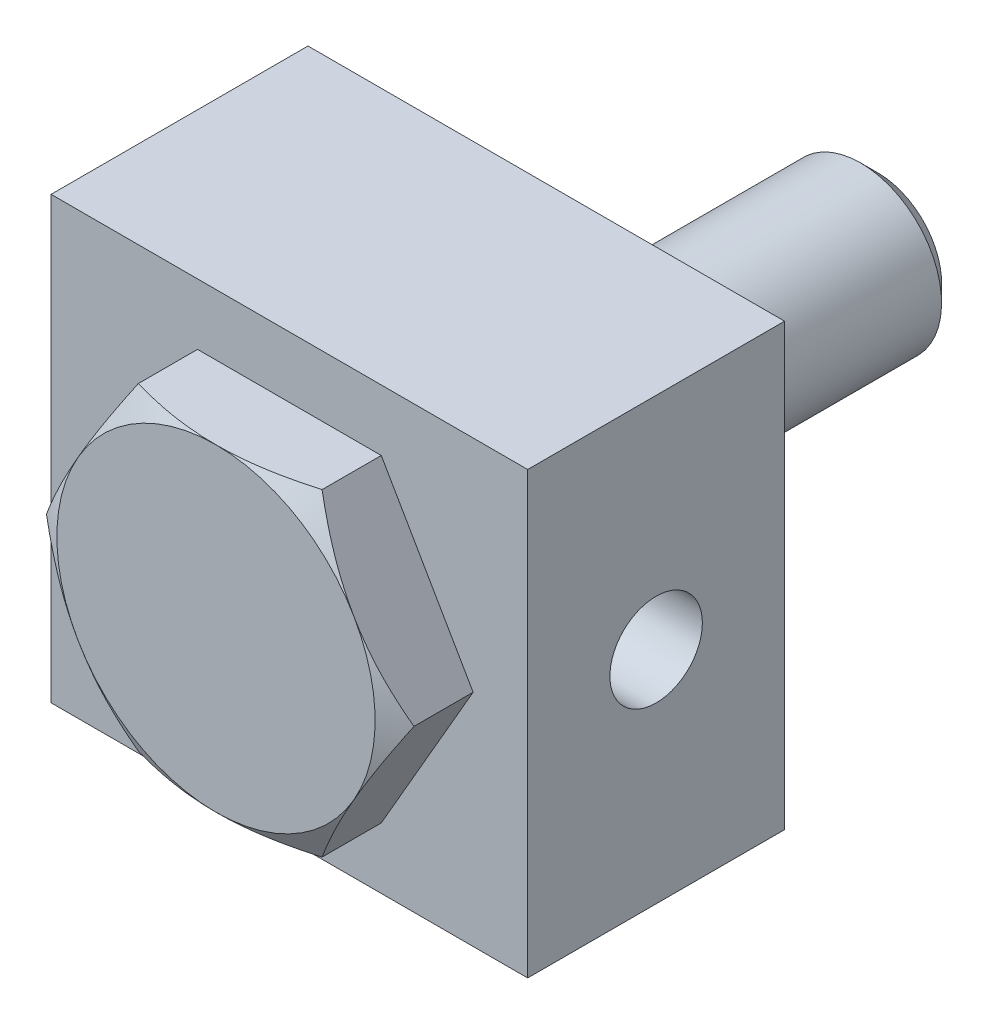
ISO-10303-21;
HEADER;
FILE_DESCRIPTION(('STEP AP214'),'2;1');
FILE_NAME('part.step','',(''),(''),'','','');
FILE_SCHEMA(('AUTOMOTIVE_DESIGN { 1 0 10303 214 1 1 1 1 }'));
ENDSEC;
DATA;
#1=APPLICATION_CONTEXT('core data for automotive mechanical design processes');
#2=APPLICATION_PROTOCOL_DEFINITION('international standard','automotive_design',2000,#1);
#3=PRODUCT_CONTEXT('',#1,'mechanical');
#4=PRODUCT('Part','Part','',(#3));
#5=PRODUCT_RELATED_PRODUCT_CATEGORY('part','',(#4));
#6=PRODUCT_DEFINITION_FORMATION('','',#4);
#7=PRODUCT_DEFINITION_CONTEXT('part definition',#1,'design');
#8=PRODUCT_DEFINITION('design','',#6,#7);
#9=PRODUCT_DEFINITION_SHAPE('','',#8);
#10=(LENGTH_UNIT() NAMED_UNIT(*) SI_UNIT(.MILLI.,.METRE.));
#11=(NAMED_UNIT(*) PLANE_ANGLE_UNIT() SI_UNIT($,.RADIAN.));
#12=(NAMED_UNIT(*) SI_UNIT($,.STERADIAN.) SOLID_ANGLE_UNIT());
#13=UNCERTAINTY_MEASURE_WITH_UNIT(LENGTH_MEASURE(1.E-05),#10,'distance_accuracy_value','');
#14=(GEOMETRIC_REPRESENTATION_CONTEXT(3) GLOBAL_UNCERTAINTY_ASSIGNED_CONTEXT((#13)) GLOBAL_UNIT_ASSIGNED_CONTEXT((#10,
#11,#12)) REPRESENTATION_CONTEXT('',''));
#15=CARTESIAN_POINT('',(0.,0.,0.));
#16=DIRECTION('',(0.,0.,1.));
#17=DIRECTION('',(1.,0.,0.));
#18=AXIS2_PLACEMENT_3D('',#15,#16,#17);
#19=CARTESIAN_POINT('',(-41.7703,41.7703,88.519));
#20=DIRECTION('',(0.,0.,1.));
#21=DIRECTION('',(0.,-1.,0.));
#22=AXIS2_PLACEMENT_3D('',#19,#20,#21);
#23=PLANE('',#22);
#24=CARTESIAN_POINT('',(0.,0.,88.519));
#25=DIRECTION('',(0.,0.,1.));
#26=DIRECTION('',(0.,-1.,0.));
#27=AXIS2_PLACEMENT_3D('',#24,#25,#26);
#28=CIRCLE('',#27,41.3);
#29=CARTESIAN_POINT('',(0.,-41.3,88.519));
#30=VERTEX_POINT('',#29);
#31=CARTESIAN_POINT('',(-35.7668491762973,-20.65,88.519));
#32=VERTEX_POINT('',#31);
#33=EDGE_CURVE('E113',#30,#32,#28,.F.);
#34=ORIENTED_EDGE('',*,*,#33,.F.);
#35=CARTESIAN_POINT('',(35.7668491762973,-20.65,88.519));
#36=VERTEX_POINT('',#35);
#37=EDGE_CURVE('E126',#36,#30,#28,.F.);
#38=ORIENTED_EDGE('',*,*,#37,.F.);
#39=CARTESIAN_POINT('',(35.7668491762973,20.65,88.519));
#40=VERTEX_POINT('',#39);
#41=EDGE_CURVE('E132',#40,#36,#28,.F.);
#42=ORIENTED_EDGE('',*,*,#41,.F.);
#43=CARTESIAN_POINT('',(0.,0.,88.519));
#44=DIRECTION('',(0.,0.,1.));
#45=DIRECTION('',(1.,0.,0.));
#46=AXIS2_PLACEMENT_3D('',#43,#44,#45);
#47=CIRCLE('',#46,41.3);
#48=CARTESIAN_POINT('',(0.,41.3,88.519));
#49=VERTEX_POINT('',#48);
#50=EDGE_CURVE('E359',#40,#49,#47,.T.);
#51=ORIENTED_EDGE('',*,*,#50,.T.);
#52=CARTESIAN_POINT('',(-35.7668491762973,20.65,88.519));
#53=VERTEX_POINT('',#52);
#54=EDGE_CURVE('E539',#53,#49,#28,.F.);
#55=ORIENTED_EDGE('',*,*,#54,.F.);
#56=EDGE_CURVE('E136',#32,#53,#28,.F.);
#57=ORIENTED_EDGE('',*,*,#56,.F.);
#58=EDGE_LOOP('',(#34,#38,#42,#51,#55,#57));
#59=FACE_BOUND('',#58,.T.);
#60=ADVANCED_FACE('F14',(#59),#23,.T.);
#61=CARTESIAN_POINT('',(0.,0.,78.8727471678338));
#62=DIRECTION('',(0.,0.,-1.));
#63=DIRECTION('',(-1.,0.,0.));
#64=AXIS2_PLACEMENT_3D('',#61,#62,#63);
#65=CONICAL_SURFACE('',#64,58.0078000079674,1.0471975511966);
#66=ORIENTED_EDGE('',*,*,#33,.T.);
#67=CARTESIAN_POINT('',(-23.8444506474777,-41.3002,84.8301661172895));
#68=CARTESIAN_POINT('',(-24.3685431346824,-40.3924451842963,85.1327273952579));
#69=CARTESIAN_POINT('',(-24.8946798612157,-39.4811496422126,85.4215586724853));
#70=CARTESIAN_POINT('',(-25.9511722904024,-37.6512510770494,85.967944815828));
#71=CARTESIAN_POINT('',(-26.4815293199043,-36.7326457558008,86.2254893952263));
#72=CARTESIAN_POINT('',(-27.5474986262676,-34.8863327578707,86.7058452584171));
#73=CARTESIAN_POINT('',(-28.0831203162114,-33.958608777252,86.9285735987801));
#74=CARTESIAN_POINT('',(-29.1580627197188,-32.0967539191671,87.3344988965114));
#75=CARTESIAN_POINT('',(-29.6973830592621,-31.1626236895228,87.5176997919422));
#76=CARTESIAN_POINT('',(-30.7659373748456,-29.3118333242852,87.8367936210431));
#77=CARTESIAN_POINT('',(-31.2950920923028,-28.3953104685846,87.973741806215));
#78=CARTESIAN_POINT('',(-32.3558261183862,-26.5580652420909,88.203371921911));
#79=CARTESIAN_POINT('',(-32.887405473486,-25.6373427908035,88.2960530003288));
#80=CARTESIAN_POINT('',(-33.9514570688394,-23.7943513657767,88.4348087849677));
#81=CARTESIAN_POINT('',(-34.4839274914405,-22.8720855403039,88.4809388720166));
#82=CARTESIAN_POINT('',(-35.5493597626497,-21.0267027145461,88.525600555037));
#83=CARTESIAN_POINT('',(-36.0823215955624,-20.1035857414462,88.524133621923));
#84=CARTESIAN_POINT('',(-37.0786961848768,-18.3778143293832,88.476926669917));
#85=CARTESIAN_POINT('',(-37.5421799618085,-17.5750368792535,88.4369431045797));
#86=CARTESIAN_POINT('',(-38.4680421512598,-15.9713965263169,88.3217374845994));
#87=CARTESIAN_POINT('',(-38.9304205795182,-15.1705335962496,88.2465159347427));
#88=CARTESIAN_POINT('',(-39.8538957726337,-13.571027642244,88.0621424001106));
#89=CARTESIAN_POINT('',(-40.3149909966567,-12.7723872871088,87.9529597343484));
#90=CARTESIAN_POINT('',(-41.2349897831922,-11.1789026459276,87.7025797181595));
#91=CARTESIAN_POINT('',(-41.6938933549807,-10.3840583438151,87.5613825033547));
#92=CARTESIAN_POINT('',(-42.6192515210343,-8.78129098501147,87.2457582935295));
#93=CARTESIAN_POINT('',(-43.0856491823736,-7.97346653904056,87.0706665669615));
#94=CARTESIAN_POINT('',(-44.0155899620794,-6.36276186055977,86.6919247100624));
#95=CARTESIAN_POINT('',(-44.4791326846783,-5.55988231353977,86.4882707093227));
#96=CARTESIAN_POINT('',(-45.4022766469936,-3.96095006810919,86.0554861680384));
#97=CARTESIAN_POINT('',(-45.8618837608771,-3.1648871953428,85.8264054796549));
#98=CARTESIAN_POINT('',(-46.7779191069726,-1.57826743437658,85.3450529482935));
#99=CARTESIAN_POINT('',(-47.2343481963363,-0.787709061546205,85.0927876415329));
#100=CARTESIAN_POINT('',(-47.689247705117,0.000199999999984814,84.8301661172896));
#101=B_SPLINE_CURVE_WITH_KNOTS('',3,(#67,#68,#69,#70,#71,#72,#73,#74,#75,#76,#77,#78,#79,#80,
#81,#82,#83,#84,#85,#86,#87,#88,#89,#90,#91,#92,#93,#94,#95,#96,#97,#98,#99,#100),.UNSPECIFIED.,
.F.,.F.,(4,2,2,2,2,2,2,2,2,2,2,2,2,2,2,2,4),(0.,3.27302247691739,6.54711819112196,
9.82889872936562,13.110352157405,16.3108811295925,19.5114717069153,22.7082500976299,
25.9049296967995,28.6877475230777,31.470525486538,34.2558247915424,37.0411122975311,
39.8878840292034,42.7350418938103,45.5767129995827,48.4175854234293),.UNSPECIFIED.);
#102=CARTESIAN_POINT('',(-23.8445661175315,-41.3,84.8302327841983));
#103=VERTEX_POINT('',#102);
#104=EDGE_CURVE('E116',#103,#32,#101,.T.);
#105=ORIENTED_EDGE('',*,*,#104,.F.);
#106=CARTESIAN_POINT('',(-64.0693641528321,-41.3,68.3538193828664));
#107=CARTESIAN_POINT('',(-63.1674107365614,-41.3,68.7914941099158));
#108=CARTESIAN_POINT('',(-62.264398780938,-41.3,69.2269946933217));
#109=CARTESIAN_POINT('',(-60.4560384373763,-41.3,70.0931399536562));
#110=CARTESIAN_POINT('',(-59.5506900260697,-41.3,70.5237845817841));
#111=CARTESIAN_POINT('',(-57.737315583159,-41.3,71.37976755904));
#112=CARTESIAN_POINT('',(-56.8292891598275,-41.3,71.8051050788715));
#113=CARTESIAN_POINT('',(-55.0104615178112,-41.3,72.6498031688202));
#114=CARTESIAN_POINT('',(-54.099660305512,-41.3,73.0691637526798));
#115=CARTESIAN_POINT('',(-52.2700525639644,-41.3,73.9034920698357));
#116=CARTESIAN_POINT('',(-51.3512294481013,-41.3,74.3184234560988));
#117=CARTESIAN_POINT('',(-49.5102220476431,-41.3,75.1407598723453));
#118=CARTESIAN_POINT('',(-48.5880377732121,-41.3,75.5481649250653));
#119=CARTESIAN_POINT('',(-46.7400185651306,-41.3,76.3545246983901));
#120=CARTESIAN_POINT('',(-45.8141837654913,-41.3,76.7534797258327));
#121=CARTESIAN_POINT('',(-43.9584905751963,-41.3,77.5419052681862));
#122=CARTESIAN_POINT('',(-43.0286322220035,-41.3,77.9313758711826));
#123=CARTESIAN_POINT('',(-41.1344932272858,-41.3,78.7120058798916));
#124=CARTESIAN_POINT('',(-40.1700683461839,-41.3,79.102815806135));
#125=CARTESIAN_POINT('',(-38.2360812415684,-41.3,79.8715362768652));
#126=CARTESIAN_POINT('',(-37.2665190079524,-41.3,80.2494467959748));
#127=CARTESIAN_POINT('',(-35.3216763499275,-41.3,80.9906628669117));
#128=CARTESIAN_POINT('',(-34.3463952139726,-41.3,81.3539665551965));
#129=CARTESIAN_POINT('',(-32.3897759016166,-41.3,82.0639044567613));
#130=CARTESIAN_POINT('',(-31.4084377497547,-41.3,82.4105387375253));
#131=CARTESIAN_POINT('',(-29.4412647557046,-41.3,83.0841522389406));
#132=CARTESIAN_POINT('',(-28.455443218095,-41.3,83.4111702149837));
#133=CARTESIAN_POINT('',(-26.4768978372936,-41.3,84.0437404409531));
#134=CARTESIAN_POINT('',(-25.4841738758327,-41.3,84.3492923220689));
#135=CARTESIAN_POINT('',(-23.4917994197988,-41.3,84.9359605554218));
#136=CARTESIAN_POINT('',(-22.4921508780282,-41.3,85.2170835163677));
#137=CARTESIAN_POINT('',(-20.4855307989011,-41.3,85.751821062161));
#138=CARTESIAN_POINT('',(-19.4785595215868,-41.3,86.0054366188));
#139=CARTESIAN_POINT('',(-17.4628765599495,-41.3,86.4804932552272));
#140=CARTESIAN_POINT('',(-16.4542050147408,-41.3,86.7021038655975));
#141=CARTESIAN_POINT('',(-14.4299865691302,-41.3,87.1113979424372));
#142=CARTESIAN_POINT('',(-13.414439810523,-41.3,87.2990821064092));
#143=CARTESIAN_POINT('',(-11.377162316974,-41.3,87.6372091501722));
#144=CARTESIAN_POINT('',(-10.3554317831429,-41.3,87.7876532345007));
#145=CARTESIAN_POINT('',(-8.30681732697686,-41.3,88.048308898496));
#146=CARTESIAN_POINT('',(-7.27993340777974,-41.3,88.1585205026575));
#147=CARTESIAN_POINT('',(-5.23591892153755,-41.3,88.3351296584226));
#148=CARTESIAN_POINT('',(-4.2188365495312,-41.3,88.4020816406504));
#149=CARTESIAN_POINT('',(-2.1827513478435,-41.3,88.4929124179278));
#150=CARTESIAN_POINT('',(-1.16374855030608,-41.3,88.5167919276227));
#151=CARTESIAN_POINT('',(0.874346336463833,-41.3,88.5209153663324));
#152=CARTESIAN_POINT('',(1.8934384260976,-41.3,88.5011590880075));
#153=CARTESIAN_POINT('',(3.92991883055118,-41.3,88.4184720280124));
#154=CARTESIAN_POINT('',(4.94730706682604,-41.3,88.3555393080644));
#155=CARTESIAN_POINT('',(6.67736113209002,-41.3,88.2128124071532));
#156=CARTESIAN_POINT('',(7.39091760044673,-41.3,88.1435535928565));
#157=CARTESIAN_POINT('',(8.81582940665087,-41.3,87.9851608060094));
#158=CARTESIAN_POINT('',(9.52718468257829,-41.3,87.8960262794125));
#159=CARTESIAN_POINT('',(11.657396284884,-41.3,87.6001099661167));
#160=CARTESIAN_POINT('',(13.072362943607,-41.3,87.364818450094));
#161=CARTESIAN_POINT('',(15.8902816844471,-41.3,86.8265351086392));
#162=CARTESIAN_POINT('',(17.2932234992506,-41.3,86.5234904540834));
#163=CARTESIAN_POINT('',(20.0850707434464,-41.3,85.8589608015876));
#164=CARTESIAN_POINT('',(21.4739763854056,-41.3,85.4974766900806));
#165=CARTESIAN_POINT('',(24.2681905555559,-41.3,84.7163388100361));
#166=CARTESIAN_POINT('',(25.6731880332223,-41.3,84.2955805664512));
#167=CARTESIAN_POINT('',(28.4693419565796,-41.3,83.4105802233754));
#168=CARTESIAN_POINT('',(29.8604983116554,-41.3,82.9463378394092));
#169=CARTESIAN_POINT('',(32.6296674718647,-41.3,81.9817397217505));
#170=CARTESIAN_POINT('',(34.0076844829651,-41.3,81.4813960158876));
#171=CARTESIAN_POINT('',(36.0661280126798,-41.3,80.7082102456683));
#172=CARTESIAN_POINT('',(36.7508455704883,-41.3,80.4467032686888));
#173=CARTESIAN_POINT('',(38.1176001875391,-41.3,79.9167638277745));
#174=CARTESIAN_POINT('',(38.7996372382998,-41.3,79.6483313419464));
#175=CARTESIAN_POINT('',(40.3980718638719,-41.3,79.0106346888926));
#176=CARTESIAN_POINT('',(41.3134382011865,-41.3,78.6387862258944));
#177=CARTESIAN_POINT('',(43.1399646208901,-41.3,77.8848826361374));
#178=CARTESIAN_POINT('',(44.0511246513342,-41.3,77.5028273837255));
#179=CARTESIAN_POINT('',(45.8696223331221,-41.3,76.7296224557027));
#180=CARTESIAN_POINT('',(46.7769598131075,-41.3,76.3384723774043));
#181=CARTESIAN_POINT('',(48.5881012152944,-41.3,75.5480693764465));
#182=CARTESIAN_POINT('',(49.4919051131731,-41.3,75.1488163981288));
#183=CARTESIAN_POINT('',(52.1988484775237,-41.3,73.9400545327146));
#184=CARTESIAN_POINT('',(53.9971500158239,-41.3,73.119700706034));
#185=CARTESIAN_POINT('',(57.5828931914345,-41.3,71.4557710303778));
#186=CARTESIAN_POINT('',(59.37033505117,-41.3,70.6121956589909));
#187=CARTESIAN_POINT('',(62.9380543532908,-41.3,68.9051912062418));
#188=CARTESIAN_POINT('',(64.7183220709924,-41.3,68.0417418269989));
#189=CARTESIAN_POINT('',(68.2711988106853,-41.3,66.2992324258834));
#190=CARTESIAN_POINT('',(70.0438078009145,-41.3,65.4201723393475));
#191=CARTESIAN_POINT('',(73.5823142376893,-41.3,63.6491967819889));
#192=CARTESIAN_POINT('',(75.3482124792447,-41.3,62.7572828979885));
#193=CARTESIAN_POINT('',(78.8744727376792,-41.3,60.9625944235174));
#194=CARTESIAN_POINT('',(80.6348347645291,-41.3,60.0598198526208));
#195=CARTESIAN_POINT('',(84.0054836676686,-41.3,58.3200977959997));
#196=CARTESIAN_POINT('',(85.6161465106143,-41.3,57.4838781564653));
#197=CARTESIAN_POINT('',(88.8339886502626,-41.3,55.8047663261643));
#198=CARTESIAN_POINT('',(90.4411679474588,-41.3,54.9618741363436));
#199=CARTESIAN_POINT('',(93.6525266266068,-41.3,53.2702676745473));
#200=CARTESIAN_POINT('',(95.2567059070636,-41.3,52.4215532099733));
#201=CARTESIAN_POINT('',(98.4623765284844,-41.3,50.7190626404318));
#202=CARTESIAN_POINT('',(100.063867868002,-41.3,49.8652865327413));
#203=CARTESIAN_POINT('',(103.260553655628,-41.3,48.1553865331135));
#204=CARTESIAN_POINT('',(104.855753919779,-41.3,47.2992735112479));
#205=CARTESIAN_POINT('',(108.044052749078,-41.3,45.5831423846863));
#206=CARTESIAN_POINT('',(109.637151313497,-41.3,44.7231242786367));
#207=CARTESIAN_POINT('',(112.821389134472,-41.3,42.9996744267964));
#208=CARTESIAN_POINT('',(114.412528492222,-41.3,42.1362428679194));
#209=CARTESIAN_POINT('',(117.593122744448,-41.3,40.4062884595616));
#210=CARTESIAN_POINT('',(119.182577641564,-41.3,39.539765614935));
#211=CARTESIAN_POINT('',(120.771287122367,-41.3,38.6718800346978));
#212=B_SPLINE_CURVE_WITH_KNOTS('',3,(#106,#107,#108,#109,#110,#111,#112,#113,#114,#115,#116,
#117,#118,#119,#120,#121,#122,#123,#124,#125,#126,#127,#128,#129,#130,#131,#132,#133,#134,#135,
#136,#137,#138,#139,#140,#141,#142,#143,#144,#145,#146,#147,#148,#149,#150,#151,#152,#153,#154,
#155,#156,#157,#158,#159,#160,#161,#162,#163,#164,#165,#166,#167,#168,#169,#170,#171,#172,#173,
#174,#175,#176,#177,#178,#179,#180,#181,#182,#183,#184,#185,#186,#187,#188,#189,#190,#191,#192,
#193,#194,#195,#196,#197,#198,#199,#200,#201,#202,#203,#204,#205,#206,#207,#208,#209,#210,#211),
.UNSPECIFIED.,.F.,.F.,(4,2,2,2,2,2,2,2,2,2,2,2,2,2,2,2,2,2,2,2,2,2,2,2,2,2,2,2,2,2,2,2,2,2,2,2,
2,2,2,2,2,2,2,2,2,2,2,2,2,2,2,2,4),(0.,3.00761084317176,6.01525188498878,9.02335716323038,
12.0314555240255,15.0559312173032,18.0803977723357,21.1047543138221,24.129082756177,
27.2507997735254,30.3725229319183,33.4946431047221,36.6167506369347,39.7324716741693,
42.8482462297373,45.963175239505,49.0779941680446,52.1756558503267,55.2732538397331,
58.3707516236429,61.4682475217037,64.5252131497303,67.5821280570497,70.63905748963,
73.6961241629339,75.8465795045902,77.9970947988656,82.2982319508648,86.6027345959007,
90.9071719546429,95.3062764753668,99.7054097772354,104.103084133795,106.301921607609,
108.500766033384,111.464728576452,114.428727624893,117.392858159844,120.357009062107,
126.286516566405,132.215902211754,138.151638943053,144.087400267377,150.022434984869,
155.957459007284,161.401840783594,166.846221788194,172.290783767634,177.735348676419,
183.166580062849,188.597813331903,194.028753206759,199.459684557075),.UNSPECIFIED.);
#213=EDGE_CURVE('E109',#30,#103,#212,.F.);
#214=ORIENTED_EDGE('',*,*,#213,.F.);
#215=EDGE_LOOP('',(#66,#105,#214));
#216=FACE_BOUND('',#215,.T.);
#217=ADVANCED_FACE('F111',(#216),#65,.T.);
#218=CARTESIAN_POINT('',(47.6892477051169,0.000200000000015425,84.8301661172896));
#219=CARTESIAN_POINT('',(47.1651552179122,-0.907554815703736,85.1327273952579));
#220=CARTESIAN_POINT('',(46.6390184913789,-1.8188503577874,85.4215586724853));
#221=CARTESIAN_POINT('',(45.5825260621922,-3.64874892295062,85.967944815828));
#222=CARTESIAN_POINT('',(45.0521690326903,-4.56735424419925,86.2254893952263));
#223=CARTESIAN_POINT('',(43.986199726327,-6.41366724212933,86.7058452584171));
#224=CARTESIAN_POINT('',(43.4505780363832,-7.34139122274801,86.9285735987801));
#225=CARTESIAN_POINT('',(42.3756356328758,-9.2032460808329,87.3344988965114));
#226=CARTESIAN_POINT('',(41.8363152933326,-10.1373763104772,87.5176997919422));
#227=CARTESIAN_POINT('',(40.767760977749,-11.9881666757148,87.8367936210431));
#228=CARTESIAN_POINT('',(40.2386062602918,-12.9046895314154,87.973741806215));
#229=CARTESIAN_POINT('',(39.1778722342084,-14.7419347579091,88.203371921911));
#230=CARTESIAN_POINT('',(38.6462928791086,-15.6626572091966,88.2960530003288));
#231=CARTESIAN_POINT('',(37.5822412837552,-17.5056486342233,88.4348087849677));
#232=CARTESIAN_POINT('',(37.0497708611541,-18.4279144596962,88.4809388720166));
#233=CARTESIAN_POINT('',(35.984338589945,-20.2732972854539,88.525600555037));
#234=CARTESIAN_POINT('',(35.4513767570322,-21.1964142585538,88.524133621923));
#235=CARTESIAN_POINT('',(34.4550021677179,-22.9221856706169,88.476926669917));
#236=CARTESIAN_POINT('',(33.9915183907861,-23.7249631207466,88.4369431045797));
#237=CARTESIAN_POINT('',(33.0656562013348,-25.3286034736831,88.3217374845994));
#238=CARTESIAN_POINT('',(32.6032777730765,-26.1294664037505,88.2465159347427));
#239=CARTESIAN_POINT('',(31.679802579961,-27.728972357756,88.0621424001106));
#240=CARTESIAN_POINT('',(31.218707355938,-28.5276127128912,87.9529597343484));
#241=CARTESIAN_POINT('',(30.2987085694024,-30.1210973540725,87.7025797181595));
#242=CARTESIAN_POINT('',(29.8398049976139,-30.915941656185,87.5613825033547));
#243=CARTESIAN_POINT('',(28.9144468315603,-32.5187090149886,87.2457582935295));
#244=CARTESIAN_POINT('',(28.4480491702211,-33.3265334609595,87.0706665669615));
#245=CARTESIAN_POINT('',(27.5181083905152,-34.9372381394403,86.6919247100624));
#246=CARTESIAN_POINT('',(27.0545656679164,-35.7401176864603,86.4882707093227));
#247=CARTESIAN_POINT('',(26.131421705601,-37.3390499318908,86.0554861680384));
#248=CARTESIAN_POINT('',(25.6718145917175,-38.1351128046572,85.8264054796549));
#249=CARTESIAN_POINT('',(24.7557792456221,-39.7217325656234,85.3450529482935));
#250=CARTESIAN_POINT('',(24.2993501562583,-40.5122909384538,85.0927876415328));
#251=CARTESIAN_POINT('',(23.8444506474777,-41.3002,84.8301661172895));
#252=B_SPLINE_CURVE_WITH_KNOTS('',3,(#218,#219,#220,#221,#222,#223,#224,#225,#226,#227,#228,
#229,#230,#231,#232,#233,#234,#235,#236,#237,#238,#239,#240,#241,#242,#243,#244,#245,#246,#247,
#248,#249,#250,#251),.UNSPECIFIED.,.F.,.F.,(4,2,2,2,2,2,2,2,2,2,2,2,2,2,2,2,4),(0.,
3.27302247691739,6.54711819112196,9.82889872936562,13.110352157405,16.3108811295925,
19.5114717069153,22.7082500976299,25.9049296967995,28.6877475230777,31.470525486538,
34.2558247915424,37.0411122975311,39.8878840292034,42.7350418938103,45.5767129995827,
48.4175854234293),.UNSPECIFIED.);
#253=CARTESIAN_POINT('',(23.8445661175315,-41.3,84.8302327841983));
#254=VERTEX_POINT('',#253);
#255=EDGE_CURVE('E121',#36,#254,#252,.T.);
#256=ORIENTED_EDGE('',*,*,#255,.F.);
#257=ORIENTED_EDGE('',*,*,#37,.T.);
#258=EDGE_CURVE('E120',#254,#30,#212,.F.);
#259=ORIENTED_EDGE('',*,*,#258,.F.);
#260=EDGE_LOOP('',(#256,#257,#259));
#261=FACE_BOUND('',#260,.T.);
#262=ADVANCED_FACE('F127',(#261),#65,.T.);
#263=CARTESIAN_POINT('',(23.8444506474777,41.3002,84.8301661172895));
#264=CARTESIAN_POINT('',(24.3685431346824,40.3924451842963,85.1327273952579));
#265=CARTESIAN_POINT('',(24.8946798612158,39.4811496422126,85.4215586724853));
#266=CARTESIAN_POINT('',(25.9511722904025,37.6512510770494,85.967944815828));
#267=CARTESIAN_POINT('',(26.4815293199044,36.7326457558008,86.2254893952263));
#268=CARTESIAN_POINT('',(27.5474986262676,34.8863327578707,86.7058452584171));
#269=CARTESIAN_POINT('',(28.0831203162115,33.958608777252,86.9285735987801));
#270=CARTESIAN_POINT('',(29.1580627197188,32.0967539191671,87.3344988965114));
#271=CARTESIAN_POINT('',(29.6973830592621,31.1626236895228,87.5176997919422));
#272=CARTESIAN_POINT('',(30.7659373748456,29.3118333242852,87.8367936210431));
#273=CARTESIAN_POINT('',(31.2950920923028,28.3953104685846,87.973741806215));
#274=CARTESIAN_POINT('',(32.3558261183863,26.5580652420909,88.203371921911));
#275=CARTESIAN_POINT('',(32.887405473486,25.6373427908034,88.2960530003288));
#276=CARTESIAN_POINT('',(33.9514570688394,23.7943513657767,88.4348087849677));
#277=CARTESIAN_POINT('',(34.4839274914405,22.8720855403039,88.4809388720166));
#278=CARTESIAN_POINT('',(35.5493597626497,21.0267027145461,88.525600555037));
#279=CARTESIAN_POINT('',(36.0823215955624,20.1035857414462,88.524133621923));
#280=CARTESIAN_POINT('',(37.0786961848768,18.3778143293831,88.476926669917));
#281=CARTESIAN_POINT('',(37.5421799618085,17.5750368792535,88.4369431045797));
#282=CARTESIAN_POINT('',(38.4680421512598,15.9713965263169,88.3217374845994));
#283=CARTESIAN_POINT('',(38.9304205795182,15.1705335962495,88.2465159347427));
#284=CARTESIAN_POINT('',(39.8538957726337,13.571027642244,88.0621424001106));
#285=CARTESIAN_POINT('',(40.3149909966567,12.7723872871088,87.9529597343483));
#286=CARTESIAN_POINT('',(41.2349897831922,11.1789026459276,87.7025797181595));
#287=CARTESIAN_POINT('',(41.6938933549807,10.3840583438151,87.5613825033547));
#288=CARTESIAN_POINT('',(42.6192515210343,8.78129098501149,87.2457582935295));
#289=CARTESIAN_POINT('',(43.0856491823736,7.97346653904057,87.0706665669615));
#290=CARTESIAN_POINT('',(44.0155899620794,6.36276186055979,86.6919247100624));
#291=CARTESIAN_POINT('',(44.4791326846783,5.55988231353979,86.4882707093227));
#292=CARTESIAN_POINT('',(45.4022766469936,3.96095006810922,86.0554861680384));
#293=CARTESIAN_POINT('',(45.8618837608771,3.16488719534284,85.8264054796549));
#294=CARTESIAN_POINT('',(46.7779191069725,1.57826743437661,85.3450529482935));
#295=CARTESIAN_POINT('',(47.2343481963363,0.787709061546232,85.0927876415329));
#296=CARTESIAN_POINT('',(47.6892477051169,-0.000199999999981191,84.8301661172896));
#297=B_SPLINE_CURVE_WITH_KNOTS('',3,(#263,#264,#265,#266,#267,#268,#269,#270,#271,#272,#273,
#274,#275,#276,#277,#278,#279,#280,#281,#282,#283,#284,#285,#286,#287,#288,#289,#290,#291,#292,
#293,#294,#295,#296),.UNSPECIFIED.,.F.,.F.,(4,2,2,2,2,2,2,2,2,2,2,2,2,2,2,2,4),(0.,
3.27302247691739,6.54711819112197,9.82889872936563,13.110352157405,16.3108811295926,
19.5114717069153,22.70825009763,25.9049296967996,28.6877475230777,31.470525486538,
34.2558247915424,37.0411122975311,39.8878840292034,42.7350418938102,45.5767129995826,
48.4175854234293),.UNSPECIFIED.);
#298=CARTESIAN_POINT('',(47.6891322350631,0.,84.8302327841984));
#299=VERTEX_POINT('',#298);
#300=EDGE_CURVE('E202',#40,#299,#297,.T.);
#301=ORIENTED_EDGE('',*,*,#300,.F.);
#302=ORIENTED_EDGE('',*,*,#41,.T.);
#303=EDGE_CURVE('E197',#299,#36,#252,.T.);
#304=ORIENTED_EDGE('',*,*,#303,.F.);
#305=EDGE_LOOP('',(#301,#302,#304));
#306=FACE_BOUND('',#305,.T.);
#307=ADVANCED_FACE('F507',(#306),#65,.T.);
#308=CARTESIAN_POINT('',(-64.0693641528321,41.3,68.3538193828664));
#309=CARTESIAN_POINT('',(-63.1674107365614,41.3,68.7914941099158));
#310=CARTESIAN_POINT('',(-62.264398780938,41.3,69.2269946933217));
#311=CARTESIAN_POINT('',(-60.4560384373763,41.3,70.0931399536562));
#312=CARTESIAN_POINT('',(-59.5506900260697,41.3,70.5237845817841));
#313=CARTESIAN_POINT('',(-57.737315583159,41.3,71.37976755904));
#314=CARTESIAN_POINT('',(-56.8292891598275,41.3,71.8051050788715));
#315=CARTESIAN_POINT('',(-55.0104615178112,41.3,72.6498031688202));
#316=CARTESIAN_POINT('',(-54.099660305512,41.3,73.0691637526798));
#317=CARTESIAN_POINT('',(-52.2700525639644,41.3,73.9034920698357));
#318=CARTESIAN_POINT('',(-51.3512294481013,41.3,74.3184234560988));
#319=CARTESIAN_POINT('',(-49.5102220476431,41.3,75.1407598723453));
#320=CARTESIAN_POINT('',(-48.5880377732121,41.3,75.5481649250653));
#321=CARTESIAN_POINT('',(-46.7400185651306,41.3,76.35452469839));
#322=CARTESIAN_POINT('',(-45.8141837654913,41.3,76.7534797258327));
#323=CARTESIAN_POINT('',(-43.9584905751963,41.3,77.5419052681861));
#324=CARTESIAN_POINT('',(-43.0286322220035,41.3,77.9313758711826));
#325=CARTESIAN_POINT('',(-41.1344932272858,41.3,78.7120058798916));
#326=CARTESIAN_POINT('',(-40.1700683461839,41.3,79.102815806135));
#327=CARTESIAN_POINT('',(-38.2360812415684,41.3,79.8715362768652));
#328=CARTESIAN_POINT('',(-37.2665190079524,41.3,80.2494467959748));
#329=CARTESIAN_POINT('',(-35.3216763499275,41.3,80.9906628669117));
#330=CARTESIAN_POINT('',(-34.3463952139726,41.3,81.3539665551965));
#331=CARTESIAN_POINT('',(-32.3897759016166,41.3,82.0639044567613));
#332=CARTESIAN_POINT('',(-31.4084377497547,41.3,82.4105387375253));
#333=CARTESIAN_POINT('',(-29.4412647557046,41.3,83.0841522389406));
#334=CARTESIAN_POINT('',(-28.455443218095,41.3,83.4111702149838));
#335=CARTESIAN_POINT('',(-26.4768978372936,41.3,84.0437404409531));
#336=CARTESIAN_POINT('',(-25.4841738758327,41.3,84.3492923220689));
#337=CARTESIAN_POINT('',(-23.4917994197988,41.3,84.9359605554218));
#338=CARTESIAN_POINT('',(-22.4921508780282,41.3,85.2170835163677));
#339=CARTESIAN_POINT('',(-20.4855307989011,41.3,85.751821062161));
#340=CARTESIAN_POINT('',(-19.4785595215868,41.3,86.0054366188));
#341=CARTESIAN_POINT('',(-17.4628765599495,41.3,86.4804932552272));
#342=CARTESIAN_POINT('',(-16.4542050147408,41.3,86.7021038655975));
#343=CARTESIAN_POINT('',(-14.4299865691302,41.3,87.1113979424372));
#344=CARTESIAN_POINT('',(-13.414439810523,41.3,87.2990821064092));
#345=CARTESIAN_POINT('',(-11.377162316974,41.3,87.6372091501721));
#346=CARTESIAN_POINT('',(-10.355431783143,41.3,87.7876532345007));
#347=CARTESIAN_POINT('',(-8.30681732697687,41.3,88.048308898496));
#348=CARTESIAN_POINT('',(-7.27993340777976,41.3,88.1585205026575));
#349=CARTESIAN_POINT('',(-5.23591892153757,41.3,88.3351296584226));
#350=CARTESIAN_POINT('',(-4.21883654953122,41.3,88.4020816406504));
#351=CARTESIAN_POINT('',(-2.18275134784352,41.3,88.4929124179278));
#352=CARTESIAN_POINT('',(-1.16374855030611,41.3,88.5167919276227));
#353=CARTESIAN_POINT('',(0.874346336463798,41.3,88.5209153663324));
#354=CARTESIAN_POINT('',(1.89343842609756,41.3,88.5011590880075));
#355=CARTESIAN_POINT('',(3.92991883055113,41.3,88.4184720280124));
#356=CARTESIAN_POINT('',(4.947307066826,41.3,88.3555393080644));
#357=CARTESIAN_POINT('',(6.67736113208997,41.3,88.2128124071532));
#358=CARTESIAN_POINT('',(7.39091760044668,41.3,88.1435535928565));
#359=CARTESIAN_POINT('',(8.81582940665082,41.3,87.9851608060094));
#360=CARTESIAN_POINT('',(9.52718468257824,41.3,87.8960262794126));
#361=CARTESIAN_POINT('',(11.6573962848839,41.3,87.6001099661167));
#362=CARTESIAN_POINT('',(13.072362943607,41.3,87.364818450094));
#363=CARTESIAN_POINT('',(15.890281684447,41.3,86.8265351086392));
#364=CARTESIAN_POINT('',(17.2932234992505,41.3,86.5234904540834));
#365=CARTESIAN_POINT('',(20.0850707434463,41.3,85.8589608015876));
#366=CARTESIAN_POINT('',(21.4739763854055,41.3,85.4974766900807));
#367=CARTESIAN_POINT('',(24.2681905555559,41.3,84.7163388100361));
#368=CARTESIAN_POINT('',(25.6731880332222,41.3,84.2955805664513));
#369=CARTESIAN_POINT('',(28.4693419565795,41.3,83.4105802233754));
#370=CARTESIAN_POINT('',(29.8604983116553,41.3,82.9463378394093));
#371=CARTESIAN_POINT('',(32.6296674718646,41.3,81.9817397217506));
#372=CARTESIAN_POINT('',(34.007684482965,41.3,81.4813960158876));
#373=CARTESIAN_POINT('',(36.0661280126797,41.3,80.7082102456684));
#374=CARTESIAN_POINT('',(36.7508455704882,41.3,80.4467032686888));
#375=CARTESIAN_POINT('',(38.117600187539,41.3,79.9167638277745));
#376=CARTESIAN_POINT('',(38.7996372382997,41.3,79.6483313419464));
#377=CARTESIAN_POINT('',(40.3980718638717,41.3,79.0106346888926));
#378=CARTESIAN_POINT('',(41.3134382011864,41.3,78.6387862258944));
#379=CARTESIAN_POINT('',(43.13996462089,41.3,77.8848826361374));
#380=CARTESIAN_POINT('',(44.0511246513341,41.3,77.5028273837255));
#381=CARTESIAN_POINT('',(45.869622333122,41.3,76.7296224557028));
#382=CARTESIAN_POINT('',(46.7769598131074,41.3,76.3384723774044));
#383=CARTESIAN_POINT('',(48.5881012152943,41.3,75.5480693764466));
#384=CARTESIAN_POINT('',(49.491905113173,41.3,75.1488163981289));
#385=CARTESIAN_POINT('',(52.1988484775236,41.3,73.9400545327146));
#386=CARTESIAN_POINT('',(53.9971500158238,41.3,73.119700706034));
#387=CARTESIAN_POINT('',(57.5828931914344,41.3,71.4557710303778));
#388=CARTESIAN_POINT('',(59.3703350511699,41.3,70.612195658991));
#389=CARTESIAN_POINT('',(62.9380543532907,41.3,68.9051912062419));
#390=CARTESIAN_POINT('',(64.7183220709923,41.3,68.0417418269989));
#391=CARTESIAN_POINT('',(68.2711988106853,41.3,66.2992324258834));
#392=CARTESIAN_POINT('',(70.0438078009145,41.3,65.4201723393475));
#393=CARTESIAN_POINT('',(73.5823142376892,41.3,63.649196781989));
#394=CARTESIAN_POINT('',(75.3482124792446,41.3,62.7572828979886));
#395=CARTESIAN_POINT('',(78.8744727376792,41.3,60.9625944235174));
#396=CARTESIAN_POINT('',(80.634834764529,41.3,60.0598198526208));
#397=CARTESIAN_POINT('',(84.0054836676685,41.3,58.3200977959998));
#398=CARTESIAN_POINT('',(85.6161465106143,41.3,57.4838781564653));
#399=CARTESIAN_POINT('',(88.8339886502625,41.3,55.8047663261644));
#400=CARTESIAN_POINT('',(90.4411679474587,41.3,54.9618741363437));
#401=CARTESIAN_POINT('',(93.6525266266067,41.3,53.2702676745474));
#402=CARTESIAN_POINT('',(95.2567059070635,41.3,52.4215532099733));
#403=CARTESIAN_POINT('',(98.4623765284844,41.3,50.7190626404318));
#404=CARTESIAN_POINT('',(100.063867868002,41.3,49.8652865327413));
#405=CARTESIAN_POINT('',(103.260553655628,41.3,48.1553865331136));
#406=CARTESIAN_POINT('',(104.855753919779,41.3,47.299273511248));
#407=CARTESIAN_POINT('',(108.044052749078,41.3,45.5831423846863));
#408=CARTESIAN_POINT('',(109.637151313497,41.3,44.7231242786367));
#409=CARTESIAN_POINT('',(112.821389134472,41.3,42.9996744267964));
#410=CARTESIAN_POINT('',(114.412528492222,41.3,42.1362428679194));
#411=CARTESIAN_POINT('',(117.593122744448,41.3,40.4062884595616));
#412=CARTESIAN_POINT('',(119.182577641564,41.3,39.539765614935));
#413=CARTESIAN_POINT('',(120.771287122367,41.3,38.6718800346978));
#414=B_SPLINE_CURVE_WITH_KNOTS('',3,(#308,#309,#310,#311,#312,#313,#314,#315,#316,#317,#318,
#319,#320,#321,#322,#323,#324,#325,#326,#327,#328,#329,#330,#331,#332,#333,#334,#335,#336,#337,
#338,#339,#340,#341,#342,#343,#344,#345,#346,#347,#348,#349,#350,#351,#352,#353,#354,#355,#356,
#357,#358,#359,#360,#361,#362,#363,#364,#365,#366,#367,#368,#369,#370,#371,#372,#373,#374,#375,
#376,#377,#378,#379,#380,#381,#382,#383,#384,#385,#386,#387,#388,#389,#390,#391,#392,#393,#394,
#395,#396,#397,#398,#399,#400,#401,#402,#403,#404,#405,#406,#407,#408,#409,#410,#411,#412,#413),
.UNSPECIFIED.,.F.,.F.,(4,2,2,2,2,2,2,2,2,2,2,2,2,2,2,2,2,2,2,2,2,2,2,2,2,2,2,2,2,2,2,2,2,2,2,2,
2,2,2,2,2,2,2,2,2,2,2,2,2,2,2,2,4),(0.,3.00761084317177,6.01525188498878,9.02335716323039,
12.0314555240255,15.0559312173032,18.0803977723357,21.1047543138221,24.129082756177,
27.2507997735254,30.3725229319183,33.4946431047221,36.6167506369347,39.7324716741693,
42.8482462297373,45.9631752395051,49.0779941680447,52.1756558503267,55.2732538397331,
58.3707516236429,61.4682475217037,64.5252131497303,67.5821280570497,70.63905748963,
73.6961241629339,75.8465795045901,77.9970947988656,82.2982319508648,86.6027345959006,
90.9071719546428,95.3062764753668,99.7054097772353,104.103084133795,106.301921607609,
108.500766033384,111.464728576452,114.428727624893,117.392858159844,120.357009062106,
126.286516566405,132.215902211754,138.151638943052,144.087400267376,150.022434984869,
155.957459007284,161.401840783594,166.846221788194,172.290783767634,177.735348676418,
183.166580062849,188.597813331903,194.028753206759,199.459684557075),.UNSPECIFIED.);
#415=CARTESIAN_POINT('',(23.8445661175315,41.3,84.8302327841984));
#416=VERTEX_POINT('',#415);
#417=EDGE_CURVE('E335',#49,#416,#414,.T.);
#418=ORIENTED_EDGE('',*,*,#417,.F.);
#419=ORIENTED_EDGE('',*,*,#50,.F.);
#420=EDGE_CURVE('E191',#416,#40,#297,.T.);
#421=ORIENTED_EDGE('',*,*,#420,.F.);
#422=EDGE_LOOP('',(#418,#419,#421));
#423=FACE_BOUND('',#422,.T.);
#424=ADVANCED_FACE('F513',(#423),#65,.T.);
#425=ORIENTED_EDGE('',*,*,#54,.T.);
#426=CARTESIAN_POINT('',(-23.8445661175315,41.3,84.8302327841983));
#427=VERTEX_POINT('',#426);
#428=EDGE_CURVE('E358',#427,#49,#414,.T.);
#429=ORIENTED_EDGE('',*,*,#428,.F.);
#430=CARTESIAN_POINT('',(-47.689247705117,-0.00020000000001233,84.8301661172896));
#431=CARTESIAN_POINT('',(-47.1651552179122,0.907554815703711,85.1327273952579));
#432=CARTESIAN_POINT('',(-46.6390184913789,1.81885035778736,85.4215586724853));
#433=CARTESIAN_POINT('',(-45.5825260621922,3.64874892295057,85.967944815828));
#434=CARTESIAN_POINT('',(-45.0521690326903,4.56735424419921,86.2254893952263));
#435=CARTESIAN_POINT('',(-43.9861997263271,6.41366724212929,86.7058452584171));
#436=CARTESIAN_POINT('',(-43.4505780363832,7.34139122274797,86.9285735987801));
#437=CARTESIAN_POINT('',(-42.3756356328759,9.20324608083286,87.3344988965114));
#438=CARTESIAN_POINT('',(-41.8363152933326,10.1373763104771,87.5176997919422));
#439=CARTESIAN_POINT('',(-40.7677609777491,11.9881666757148,87.8367936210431));
#440=CARTESIAN_POINT('',(-40.2386062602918,12.9046895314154,87.973741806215));
#441=CARTESIAN_POINT('',(-39.1778722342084,14.7419347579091,88.203371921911));
#442=CARTESIAN_POINT('',(-38.6462928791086,15.6626572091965,88.2960530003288));
#443=CARTESIAN_POINT('',(-37.5822412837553,17.5056486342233,88.4348087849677));
#444=CARTESIAN_POINT('',(-37.0497708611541,18.4279144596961,88.4809388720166));
#445=CARTESIAN_POINT('',(-35.984338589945,20.2732972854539,88.525600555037));
#446=CARTESIAN_POINT('',(-35.4513767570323,21.1964142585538,88.524133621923));
#447=CARTESIAN_POINT('',(-34.4550021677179,22.9221856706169,88.476926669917));
#448=CARTESIAN_POINT('',(-33.9915183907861,23.7249631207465,88.4369431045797));
#449=CARTESIAN_POINT('',(-33.0656562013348,25.3286034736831,88.3217374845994));
#450=CARTESIAN_POINT('',(-32.6032777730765,26.1294664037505,88.2465159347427));
#451=CARTESIAN_POINT('',(-31.679802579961,27.728972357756,88.0621424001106));
#452=CARTESIAN_POINT('',(-31.218707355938,28.5276127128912,87.9529597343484));
#453=CARTESIAN_POINT('',(-30.2987085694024,30.1210973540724,87.7025797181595));
#454=CARTESIAN_POINT('',(-29.8398049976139,30.9159416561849,87.5613825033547));
#455=CARTESIAN_POINT('',(-28.9144468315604,32.5187090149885,87.2457582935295));
#456=CARTESIAN_POINT('',(-28.4480491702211,33.3265334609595,87.0706665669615));
#457=CARTESIAN_POINT('',(-27.5181083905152,34.9372381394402,86.6919247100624));
#458=CARTESIAN_POINT('',(-27.0545656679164,35.7401176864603,86.4882707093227));
#459=CARTESIAN_POINT('',(-26.131421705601,37.3390499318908,86.0554861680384));
#460=CARTESIAN_POINT('',(-25.6718145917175,38.1351128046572,85.8264054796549));
#461=CARTESIAN_POINT('',(-24.7557792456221,39.7217325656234,85.3450529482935));
#462=CARTESIAN_POINT('',(-24.2993501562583,40.5122909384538,85.0927876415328));
#463=CARTESIAN_POINT('',(-23.8444506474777,41.3002,84.8301661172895));
#464=B_SPLINE_CURVE_WITH_KNOTS('',3,(#430,#431,#432,#433,#434,#435,#436,#437,#438,#439,#440,
#441,#442,#443,#444,#445,#446,#447,#448,#449,#450,#451,#452,#453,#454,#455,#456,#457,#458,#459,
#460,#461,#462,#463),.UNSPECIFIED.,.F.,.F.,(4,2,2,2,2,2,2,2,2,2,2,2,2,2,2,2,4),(0.,
3.27302247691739,6.54711819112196,9.82889872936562,13.110352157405,16.3108811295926,
19.5114717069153,22.7082500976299,25.9049296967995,28.6877475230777,31.470525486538,
34.2558247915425,37.0411122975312,39.8878840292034,42.7350418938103,45.5767129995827,
48.4175854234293),.UNSPECIFIED.);
#465=EDGE_CURVE('E37',#53,#427,#464,.T.);
#466=ORIENTED_EDGE('',*,*,#465,.F.);
#467=EDGE_LOOP('',(#425,#429,#466));
#468=FACE_BOUND('',#467,.T.);
#469=ADVANCED_FACE('F506',(#468),#65,.T.);
#470=ORIENTED_EDGE('',*,*,#56,.T.);
#471=CARTESIAN_POINT('',(-47.6891322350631,0.,84.8302327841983));
#472=VERTEX_POINT('',#471);
#473=EDGE_CURVE('E190',#472,#53,#464,.T.);
#474=ORIENTED_EDGE('',*,*,#473,.F.);
#475=EDGE_CURVE('E29',#32,#472,#101,.T.);
#476=ORIENTED_EDGE('',*,*,#475,.F.);
#477=EDGE_LOOP('',(#470,#474,#476));
#478=FACE_BOUND('',#477,.T.);
#479=ADVANCED_FACE('F173',(#478),#65,.T.);
#480=CARTESIAN_POINT('',(-47.6891322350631,0.,214.692584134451));
#481=DIRECTION('',(0.866025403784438,0.5,0.));
#482=DIRECTION('',(-0.5,0.866025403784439,0.));
#483=AXIS2_PLACEMENT_3D('',#480,#481,#482);
#484=PLANE('',#483);
#485=DIRECTION('',(0.,0.,-1.));
#486=VECTOR('',#485,1.);
#487=CARTESIAN_POINT('',(-23.8445661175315,-41.3,214.692584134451));
#488=LINE('',#487,#486);
#489=CARTESIAN_POINT('',(-23.8445661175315,-41.3,69.469));
#490=VERTEX_POINT('',#489);
#491=EDGE_CURVE('E208',#103,#490,#488,.T.);
#492=ORIENTED_EDGE('',*,*,#491,.F.);
#493=ORIENTED_EDGE('',*,*,#104,.T.);
#494=ORIENTED_EDGE('',*,*,#475,.T.);
#495=DIRECTION('',(0.,0.,-1.));
#496=VECTOR('',#495,1.);
#497=CARTESIAN_POINT('',(-47.6891322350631,0.,214.692584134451));
#498=LINE('',#497,#496);
#499=CARTESIAN_POINT('',(-47.6891322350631,0.,69.469));
#500=VERTEX_POINT('',#499);
#501=EDGE_CURVE('E215',#472,#500,#498,.T.);
#502=ORIENTED_EDGE('',*,*,#501,.T.);
#503=DIRECTION('',(0.5,-0.866025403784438,0.));
#504=VECTOR('',#503,1.);
#505=CARTESIAN_POINT('',(-47.6891322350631,0.,69.469));
#506=LINE('',#505,#504);
#507=EDGE_CURVE('E210',#500,#490,#506,.T.);
#508=ORIENTED_EDGE('',*,*,#507,.T.);
#509=EDGE_LOOP('',(#492,#493,#494,#502,#508));
#510=FACE_BOUND('',#509,.T.);
#511=ADVANCED_FACE('F167',(#510),#484,.F.);
#512=CARTESIAN_POINT('',(-23.8445661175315,-41.3,214.692584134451));
#513=DIRECTION('',(0.,1.,0.));
#514=DIRECTION('',(0.,0.,1.));
#515=AXIS2_PLACEMENT_3D('',#512,#513,#514);
#516=PLANE('',#515);
#517=DIRECTION('',(0.,0.,-1.));
#518=VECTOR('',#517,1.);
#519=CARTESIAN_POINT('',(23.8445661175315,-41.3,214.692584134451));
#520=LINE('',#519,#518);
#521=CARTESIAN_POINT('',(23.8445661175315,-41.3,69.469));
#522=VERTEX_POINT('',#521);
#523=EDGE_CURVE('E140',#254,#522,#520,.T.);
#524=ORIENTED_EDGE('',*,*,#523,.F.);
#525=ORIENTED_EDGE('',*,*,#258,.T.);
#526=ORIENTED_EDGE('',*,*,#213,.T.);
#527=ORIENTED_EDGE('',*,*,#491,.T.);
#528=DIRECTION('',(1.,0.,0.));
#529=VECTOR('',#528,1.);
#530=CARTESIAN_POINT('',(-23.8445661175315,-41.3,69.469));
#531=LINE('',#530,#529);
#532=EDGE_CURVE('E212',#490,#522,#531,.T.);
#533=ORIENTED_EDGE('',*,*,#532,.T.);
#534=EDGE_LOOP('',(#524,#525,#526,#527,#533));
#535=FACE_BOUND('',#534,.T.);
#536=ADVANCED_FACE('F138',(#535),#516,.F.);
#537=CARTESIAN_POINT('',(23.8445661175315,-41.3,214.692584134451));
#538=DIRECTION('',(-0.866025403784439,0.5,0.));
#539=DIRECTION('',(-0.5,-0.866025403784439,0.));
#540=AXIS2_PLACEMENT_3D('',#537,#538,#539);
#541=PLANE('',#540);
#542=DIRECTION('',(0.,0.,-1.));
#543=VECTOR('',#542,1.);
#544=CARTESIAN_POINT('',(47.6891322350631,0.,214.692584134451));
#545=LINE('',#544,#543);
#546=CARTESIAN_POINT('',(47.6891322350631,0.,69.469));
#547=VERTEX_POINT('',#546);
#548=EDGE_CURVE('E222',#299,#547,#545,.T.);
#549=ORIENTED_EDGE('',*,*,#548,.F.);
#550=ORIENTED_EDGE('',*,*,#303,.T.);
#551=ORIENTED_EDGE('',*,*,#255,.T.);
#552=ORIENTED_EDGE('',*,*,#523,.T.);
#553=DIRECTION('',(0.5,0.866025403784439,0.));
#554=VECTOR('',#553,1.);
#555=CARTESIAN_POINT('',(23.8445661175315,-41.3,69.469));
#556=LINE('',#555,#554);
#557=EDGE_CURVE('E221',#522,#547,#556,.T.);
#558=ORIENTED_EDGE('',*,*,#557,.T.);
#559=EDGE_LOOP('',(#549,#550,#551,#552,#558));
#560=FACE_BOUND('',#559,.T.);
#561=ADVANCED_FACE('F166',(#560),#541,.F.);
#562=CARTESIAN_POINT('',(47.6891322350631,0.,214.692584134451));
#563=DIRECTION('',(-0.866025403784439,-0.5,0.));
#564=DIRECTION('',(0.5,-0.866025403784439,0.));
#565=AXIS2_PLACEMENT_3D('',#562,#563,#564);
#566=PLANE('',#565);
#567=DIRECTION('',(0.,0.,-1.));
#568=VECTOR('',#567,1.);
#569=CARTESIAN_POINT('',(23.8445661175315,41.3,214.692584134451));
#570=LINE('',#569,#568);
#571=CARTESIAN_POINT('',(23.8445661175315,41.3,69.469));
#572=VERTEX_POINT('',#571);
#573=EDGE_CURVE('E225',#416,#572,#570,.T.);
#574=ORIENTED_EDGE('',*,*,#573,.F.);
#575=ORIENTED_EDGE('',*,*,#420,.T.);
#576=ORIENTED_EDGE('',*,*,#300,.T.);
#577=ORIENTED_EDGE('',*,*,#548,.T.);
#578=DIRECTION('',(-0.5,0.866025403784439,0.));
#579=VECTOR('',#578,1.);
#580=CARTESIAN_POINT('',(47.6891322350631,0.,69.469));
#581=LINE('',#580,#579);
#582=EDGE_CURVE('E224',#547,#572,#581,.T.);
#583=ORIENTED_EDGE('',*,*,#582,.T.);
#584=EDGE_LOOP('',(#574,#575,#576,#577,#583));
#585=FACE_BOUND('',#584,.T.);
#586=ADVANCED_FACE('F338',(#585),#566,.F.);
#587=CARTESIAN_POINT('',(23.8445661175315,41.3,214.692584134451));
#588=DIRECTION('',(0.,-1.,0.));
#589=DIRECTION('',(0.,0.,-1.));
#590=AXIS2_PLACEMENT_3D('',#587,#588,#589);
#591=PLANE('',#590);
#592=DIRECTION('',(0.,0.,-1.));
#593=VECTOR('',#592,1.);
#594=CARTESIAN_POINT('',(-23.8445661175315,41.3,214.692584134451));
#595=LINE('',#594,#593);
#596=CARTESIAN_POINT('',(-23.8445661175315,41.3,69.469));
#597=VERTEX_POINT('',#596);
#598=EDGE_CURVE('E141',#427,#597,#595,.T.);
#599=ORIENTED_EDGE('',*,*,#598,.F.);
#600=ORIENTED_EDGE('',*,*,#428,.T.);
#601=ORIENTED_EDGE('',*,*,#417,.T.);
#602=ORIENTED_EDGE('',*,*,#573,.T.);
#603=DIRECTION('',(-1.,0.,0.));
#604=VECTOR('',#603,1.);
#605=CARTESIAN_POINT('',(23.8445661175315,41.3,69.469));
#606=LINE('',#605,#604);
#607=EDGE_CURVE('E158',#572,#597,#606,.T.);
#608=ORIENTED_EDGE('',*,*,#607,.T.);
#609=EDGE_LOOP('',(#599,#600,#601,#602,#608));
#610=FACE_BOUND('',#609,.T.);
#611=ADVANCED_FACE('F180',(#610),#591,.F.);
#612=CARTESIAN_POINT('',(-23.8445661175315,41.3,214.692584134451));
#613=DIRECTION('',(0.866025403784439,-0.5,0.));
#614=DIRECTION('',(0.5,0.866025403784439,0.));
#615=AXIS2_PLACEMENT_3D('',#612,#613,#614);
#616=PLANE('',#615);
#617=ORIENTED_EDGE('',*,*,#501,.F.);
#618=ORIENTED_EDGE('',*,*,#473,.T.);
#619=ORIENTED_EDGE('',*,*,#465,.T.);
#620=ORIENTED_EDGE('',*,*,#598,.T.);
#621=DIRECTION('',(-0.5,-0.866025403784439,0.));
#622=VECTOR('',#621,1.);
#623=CARTESIAN_POINT('',(-23.8445661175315,41.3,69.469));
#624=LINE('',#623,#622);
#625=EDGE_CURVE('E142',#597,#500,#624,.T.);
#626=ORIENTED_EDGE('',*,*,#625,.T.);
#627=EDGE_LOOP('',(#617,#618,#619,#620,#626));
#628=FACE_BOUND('',#627,.T.);
#629=ADVANCED_FACE('F175',(#628),#616,.F.);
#630=CARTESIAN_POINT('',(-61.849,-57.15,69.469));
#631=DIRECTION('',(0.,0.,-1.));
#632=DIRECTION('',(0.,1.,0.));
#633=AXIS2_PLACEMENT_3D('',#630,#631,#632);
#634=PLANE('',#633);
#635=DIRECTION('',(0.,-1.,0.));
#636=VECTOR('',#635,1.);
#637=CARTESIAN_POINT('',(-61.849,0.,69.469));
#638=LINE('',#637,#636);
#639=CARTESIAN_POINT('',(-61.849,57.15,69.469));
#640=VERTEX_POINT('',#639);
#641=CARTESIAN_POINT('',(-61.849,-57.15,69.469));
#642=VERTEX_POINT('',#641);
#643=EDGE_CURVE('E133',#640,#642,#638,.T.);
#644=ORIENTED_EDGE('',*,*,#643,.T.);
#645=DIRECTION('',(-1.,0.,0.));
#646=VECTOR('',#645,1.);
#647=CARTESIAN_POINT('',(0.,-57.15,69.469));
#648=LINE('',#647,#646);
#649=CARTESIAN_POINT('',(61.849,-57.15,69.469));
#650=VERTEX_POINT('',#649);
#651=EDGE_CURVE('E242',#650,#642,#648,.T.);
#652=ORIENTED_EDGE('',*,*,#651,.F.);
#653=DIRECTION('',(0.,-1.,0.));
#654=VECTOR('',#653,1.);
#655=CARTESIAN_POINT('',(61.849,0.,69.469));
#656=LINE('',#655,#654);
#657=CARTESIAN_POINT('',(61.849,57.15,69.469));
#658=VERTEX_POINT('',#657);
#659=EDGE_CURVE('E244',#658,#650,#656,.T.);
#660=ORIENTED_EDGE('',*,*,#659,.F.);
#661=DIRECTION('',(1.,0.,0.));
#662=VECTOR('',#661,1.);
#663=CARTESIAN_POINT('',(0.,57.15,69.469));
#664=LINE('',#663,#662);
#665=EDGE_CURVE('E246',#640,#658,#664,.T.);
#666=ORIENTED_EDGE('',*,*,#665,.F.);
#667=EDGE_LOOP('',(#644,#652,#660,#666));
#668=FACE_BOUND('',#667,.T.);
#669=ORIENTED_EDGE('',*,*,#625,.F.);
#670=ORIENTED_EDGE('',*,*,#607,.F.);
#671=ORIENTED_EDGE('',*,*,#582,.F.);
#672=ORIENTED_EDGE('',*,*,#557,.F.);
#673=ORIENTED_EDGE('',*,*,#532,.F.);
#674=ORIENTED_EDGE('',*,*,#507,.F.);
#675=EDGE_LOOP('',(#669,#670,#671,#672,#673,#674));
#676=FACE_BOUND('',#675,.T.);
#677=ADVANCED_FACE('F179',(#668,#676),#634,.F.);
#678=CARTESIAN_POINT('',(61.849,-57.15,2.794));
#679=DIRECTION('',(-1.,0.,0.));
#680=DIRECTION('',(0.,0.,1.));
#681=AXIS2_PLACEMENT_3D('',#678,#679,#680);
#682=PLANE('',#681);
#683=CARTESIAN_POINT('',(61.849,0.,36.1315));
#684=DIRECTION('',(1.,0.,0.));
#685=DIRECTION('',(0.,0.,-1.));
#686=AXIS2_PLACEMENT_3D('',#683,#684,#685);
#687=CIRCLE('',#686,12.);
#688=CARTESIAN_POINT('',(61.849,0.,24.1315));
#689=VERTEX_POINT('',#688);
#690=EDGE_CURVE('E365',#689,#689,#687,.T.);
#691=ORIENTED_EDGE('',*,*,#690,.F.);
#692=EDGE_LOOP('',(#691));
#693=FACE_BOUND('',#692,.T.);
#694=ORIENTED_EDGE('',*,*,#659,.T.);
#695=DIRECTION('',(0.,0.,-1.));
#696=VECTOR('',#695,1.);
#697=CARTESIAN_POINT('',(61.849,-57.15,36.1315));
#698=LINE('',#697,#696);
#699=CARTESIAN_POINT('',(61.849,-57.15,2.794));
#700=VERTEX_POINT('',#699);
#701=EDGE_CURVE('E230',#650,#700,#698,.T.);
#702=ORIENTED_EDGE('',*,*,#701,.T.);
#703=DIRECTION('',(0.,-1.,0.));
#704=VECTOR('',#703,1.);
#705=CARTESIAN_POINT('',(61.849,0.,2.794));
#706=LINE('',#705,#704);
#707=CARTESIAN_POINT('',(61.849,57.15,2.794));
#708=VERTEX_POINT('',#707);
#709=EDGE_CURVE('E254',#708,#700,#706,.T.);
#710=ORIENTED_EDGE('',*,*,#709,.F.);
#711=DIRECTION('',(0.,0.,1.));
#712=VECTOR('',#711,1.);
#713=CARTESIAN_POINT('',(61.849,57.15,36.1315));
#714=LINE('',#713,#712);
#715=EDGE_CURVE('E248',#708,#658,#714,.T.);
#716=ORIENTED_EDGE('',*,*,#715,.T.);
#717=EDGE_LOOP('',(#694,#702,#710,#716));
#718=FACE_BOUND('',#717,.T.);
#719=ADVANCED_FACE('F285',(#693,#718),#682,.F.);
#720=CARTESIAN_POINT('',(-61.849,57.15,69.469));
#721=DIRECTION('',(0.,-1.,0.));
#722=DIRECTION('',(0.,0.,-1.));
#723=AXIS2_PLACEMENT_3D('',#720,#721,#722);
#724=PLANE('',#723);
#725=ORIENTED_EDGE('',*,*,#715,.F.);
#726=DIRECTION('',(1.,0.,0.));
#727=VECTOR('',#726,1.);
#728=CARTESIAN_POINT('',(0.,57.15,2.794));
#729=LINE('',#728,#727);
#730=CARTESIAN_POINT('',(-61.849,57.15,2.794));
#731=VERTEX_POINT('',#730);
#732=EDGE_CURVE('E251',#731,#708,#729,.T.);
#733=ORIENTED_EDGE('',*,*,#732,.F.);
#734=DIRECTION('',(0.,0.,1.));
#735=VECTOR('',#734,1.);
#736=CARTESIAN_POINT('',(-61.849,57.15,36.1315));
#737=LINE('',#736,#735);
#738=EDGE_CURVE('E233',#731,#640,#737,.T.);
#739=ORIENTED_EDGE('',*,*,#738,.T.);
#740=ORIENTED_EDGE('',*,*,#665,.T.);
#741=EDGE_LOOP('',(#725,#733,#739,#740));
#742=FACE_BOUND('',#741,.T.);
#743=ADVANCED_FACE('F288',(#742),#724,.F.);
#744=CARTESIAN_POINT('',(-61.849,-57.15,69.469));
#745=DIRECTION('',(1.,0.,0.));
#746=DIRECTION('',(0.,0.,-1.));
#747=AXIS2_PLACEMENT_3D('',#744,#745,#746);
#748=PLANE('',#747);
#749=CARTESIAN_POINT('',(-61.849,0.,36.1315));
#750=DIRECTION('',(1.,0.,0.));
#751=DIRECTION('',(0.,0.,-1.));
#752=AXIS2_PLACEMENT_3D('',#749,#750,#751);
#753=CIRCLE('',#752,12.);
#754=CARTESIAN_POINT('',(-61.849,0.,24.1315));
#755=VERTEX_POINT('',#754);
#756=EDGE_CURVE('E311',#755,#755,#753,.T.);
#757=ORIENTED_EDGE('',*,*,#756,.T.);
#758=EDGE_LOOP('',(#757));
#759=FACE_BOUND('',#758,.T.);
#760=ORIENTED_EDGE('',*,*,#738,.F.);
#761=DIRECTION('',(0.,1.,0.));
#762=VECTOR('',#761,1.);
#763=CARTESIAN_POINT('',(-61.849,0.,2.794));
#764=LINE('',#763,#762);
#765=CARTESIAN_POINT('',(-61.849,-57.15,2.794));
#766=VERTEX_POINT('',#765);
#767=EDGE_CURVE('E236',#766,#731,#764,.T.);
#768=ORIENTED_EDGE('',*,*,#767,.F.);
#769=DIRECTION('',(0.,0.,-1.));
#770=VECTOR('',#769,1.);
#771=CARTESIAN_POINT('',(-61.849,-57.15,36.1315));
#772=LINE('',#771,#770);
#773=EDGE_CURVE('E239',#642,#766,#772,.T.);
#774=ORIENTED_EDGE('',*,*,#773,.F.);
#775=ORIENTED_EDGE('',*,*,#643,.F.);
#776=EDGE_LOOP('',(#760,#768,#774,#775));
#777=FACE_BOUND('',#776,.T.);
#778=ADVANCED_FACE('F293',(#759,#777),#748,.F.);
#779=CARTESIAN_POINT('',(-61.849,-57.15,2.794));
#780=DIRECTION('',(0.,1.,0.));
#781=DIRECTION('',(0.,0.,1.));
#782=AXIS2_PLACEMENT_3D('',#779,#780,#781);
#783=PLANE('',#782);
#784=ORIENTED_EDGE('',*,*,#773,.T.);
#785=DIRECTION('',(-1.,0.,0.));
#786=VECTOR('',#785,1.);
#787=CARTESIAN_POINT('',(0.,-57.15,2.794));
#788=LINE('',#787,#786);
#789=EDGE_CURVE('E256',#700,#766,#788,.T.);
#790=ORIENTED_EDGE('',*,*,#789,.F.);
#791=ORIENTED_EDGE('',*,*,#701,.F.);
#792=ORIENTED_EDGE('',*,*,#651,.T.);
#793=EDGE_LOOP('',(#784,#790,#791,#792));
#794=FACE_BOUND('',#793,.T.);
#795=ADVANCED_FACE('F290',(#794),#783,.F.);
#796=CARTESIAN_POINT('',(-61.849,-57.15,2.794));
#797=DIRECTION('',(0.,0.,-1.));
#798=DIRECTION('',(0.,1.,0.));
#799=AXIS2_PLACEMENT_3D('',#796,#797,#798);
#800=PLANE('',#799);
#801=ORIENTED_EDGE('',*,*,#709,.T.);
#802=ORIENTED_EDGE('',*,*,#789,.T.);
#803=ORIENTED_EDGE('',*,*,#767,.T.);
#804=ORIENTED_EDGE('',*,*,#732,.T.);
#805=EDGE_LOOP('',(#801,#802,#803,#804));
#806=FACE_BOUND('',#805,.T.);
#807=CARTESIAN_POINT('',(0.,0.,2.794));
#808=DIRECTION('',(0.,0.,-1.));
#809=DIRECTION('',(0.,1.,0.));
#810=AXIS2_PLACEMENT_3D('',#807,#808,#809);
#811=CIRCLE('',#810,31.5879553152);
#812=CARTESIAN_POINT('',(0.,31.5879553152,2.79399999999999));
#813=VERTEX_POINT('',#812);
#814=EDGE_CURVE('E362',#813,#813,#811,.T.);
#815=ORIENTED_EDGE('',*,*,#814,.F.);
#816=EDGE_LOOP('',(#815));
#817=FACE_BOUND('',#816,.T.);
#818=ADVANCED_FACE('F283',(#806,#817),#800,.T.);
#819=CARTESIAN_POINT('',(-31.7099627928,-31.7099627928,0.));
#820=DIRECTION('',(0.,0.,-1.));
#821=DIRECTION('',(0.,1.,0.));
#822=AXIS2_PLACEMENT_3D('',#819,#820,#821);
#823=PLANE('',#822);
#824=CARTESIAN_POINT('',(0.,0.,0.));
#825=DIRECTION('',(0.,0.,-1.));
#826=DIRECTION('',(0.,1.,0.));
#827=AXIS2_PLACEMENT_3D('',#824,#825,#826);
#828=CIRCLE('',#827,21.);
#829=CARTESIAN_POINT('',(0.,21.,0.));
#830=VERTEX_POINT('',#829);
#831=EDGE_CURVE('E368',#830,#830,#828,.T.);
#832=ORIENTED_EDGE('',*,*,#831,.F.);
#833=EDGE_LOOP('',(#832));
#834=FACE_BOUND('',#833,.T.);
#835=CARTESIAN_POINT('',(0.,0.,0.));
#836=DIRECTION('',(0.,0.,-1.));
#837=DIRECTION('',(0.,-1.,0.));
#838=AXIS2_PLACEMENT_3D('',#835,#836,#837);
#839=CIRCLE('',#838,31.5879553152);
#840=CARTESIAN_POINT('',(0.,-31.5879553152,0.));
#841=VERTEX_POINT('',#840);
#842=EDGE_CURVE('E227',#841,#841,#839,.T.);
#843=ORIENTED_EDGE('',*,*,#842,.T.);
#844=EDGE_LOOP('',(#843));
#845=FACE_BOUND('',#844,.T.);
#846=ADVANCED_FACE('F280',(#834,#845),#823,.T.);
#847=CARTESIAN_POINT('',(0.,0.,20.7518));
#848=DIRECTION('',(0.,0.,-1.));
#849=DIRECTION('',(-1.,0.,0.));
#850=AXIS2_PLACEMENT_3D('',#847,#848,#849);
#851=CYLINDRICAL_SURFACE('',#850,31.5879553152);
#852=ORIENTED_EDGE('',*,*,#814,.T.);
#853=EDGE_LOOP('',(#852));
#854=FACE_BOUND('',#853,.T.);
#855=ORIENTED_EDGE('',*,*,#842,.F.);
#856=EDGE_LOOP('',(#855));
#857=FACE_BOUND('',#856,.T.);
#858=ADVANCED_FACE('F182',(#854,#857),#851,.T.);
#859=CARTESIAN_POINT('',(-61.849,0.,36.1315));
#860=DIRECTION('',(1.,0.,0.));
#861=DIRECTION('',(0.,0.,-1.));
#862=AXIS2_PLACEMENT_3D('',#859,#860,#861);
#863=CYLINDRICAL_SURFACE('',#862,12.);
#864=ORIENTED_EDGE('',*,*,#756,.F.);
#865=EDGE_LOOP('',(#864));
#866=FACE_BOUND('',#865,.T.);
#867=ORIENTED_EDGE('',*,*,#690,.T.);
#868=EDGE_LOOP('',(#867));
#869=FACE_BOUND('',#868,.T.);
#870=ADVANCED_FACE('F377',(#866,#869),#863,.F.);
#871=CARTESIAN_POINT('',(0.,0.,-83.3));
#872=DIRECTION('',(0.,0.,1.));
#873=DIRECTION('',(0.,-1.,0.));
#874=AXIS2_PLACEMENT_3D('',#871,#872,#873);
#875=CYLINDRICAL_SURFACE('',#874,21.);
#876=CARTESIAN_POINT('',(0.,0.,-78.8));
#877=DIRECTION('',(0.,0.,-1.));
#878=DIRECTION('',(0.,1.,0.));
#879=AXIS2_PLACEMENT_3D('',#876,#877,#878);
#880=CIRCLE('',#879,21.);
#881=CARTESIAN_POINT('',(0.,21.,-78.8));
#882=VERTEX_POINT('',#881);
#883=EDGE_CURVE('E9',#882,#882,#880,.F.);
#884=ORIENTED_EDGE('',*,*,#883,.T.);
#885=EDGE_LOOP('',(#884));
#886=FACE_BOUND('',#885,.T.);
#887=ORIENTED_EDGE('',*,*,#831,.T.);
#888=EDGE_LOOP('',(#887));
#889=FACE_BOUND('',#888,.T.);
#890=ADVANCED_FACE('F271',(#886,#889),#875,.T.);
#891=CARTESIAN_POINT('',(0.,0.,-83.3));
#892=DIRECTION('',(0.,0.,-1.));
#893=DIRECTION('',(0.,1.,0.));
#894=AXIS2_PLACEMENT_3D('',#891,#892,#893);
#895=PLANE('',#894);
#896=CARTESIAN_POINT('',(0.,0.,-83.3));
#897=DIRECTION('',(0.,0.,-1.));
#898=DIRECTION('',(0.,1.,0.));
#899=AXIS2_PLACEMENT_3D('',#896,#897,#898);
#900=CIRCLE('',#899,16.5);
#901=CARTESIAN_POINT('',(0.,16.5,-83.3));
#902=VERTEX_POINT('',#901);
#903=EDGE_CURVE('E22',#902,#902,#900,.T.);
#904=ORIENTED_EDGE('',*,*,#903,.T.);
#905=EDGE_LOOP('',(#904));
#906=FACE_BOUND('',#905,.T.);
#907=ADVANCED_FACE('F262',(#906),#895,.T.);
#908=CARTESIAN_POINT('',(0.,0.,-83.3));
#909=DIRECTION('',(0.,0.,1.));
#910=DIRECTION('',(0.,-1.,0.));
#911=AXIS2_PLACEMENT_3D('',#908,#909,#910);
#912=CONICAL_SURFACE('',#911,16.5,0.785398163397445);
#913=ORIENTED_EDGE('',*,*,#883,.F.);
#914=EDGE_LOOP('',(#913));
#915=FACE_BOUND('',#914,.T.);
#916=ORIENTED_EDGE('',*,*,#903,.F.);
#917=EDGE_LOOP('',(#916));
#918=FACE_BOUND('',#917,.T.);
#919=ADVANCED_FACE('F16',(#915,#918),#912,.T.);
#920=CLOSED_SHELL('',(#60,#217,#262,#307,#424,#469,#479,#511,#536,#561,#586,#611,#629,#677,#719,
#743,#778,#795,#818,#846,#858,#870,#890,#907,#919));
#921=MANIFOLD_SOLID_BREP('B1',#920);
#922=ADVANCED_BREP_SHAPE_REPRESENTATION('',(#18,#921),#14);
#923=SHAPE_DEFINITION_REPRESENTATION(#9,#922);
ENDSEC;
END-ISO-10303-21;
